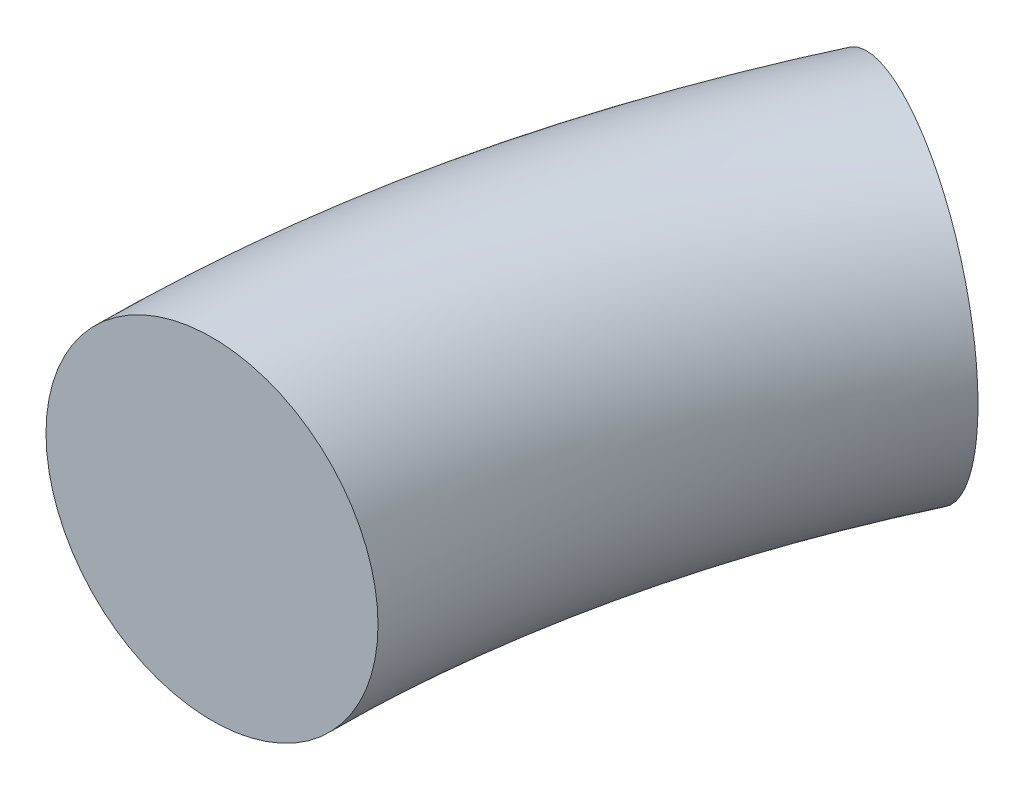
ISO-10303-21;
HEADER;
FILE_DESCRIPTION(('STEP AP214'),'2;1');
FILE_NAME('part.step','',(''),(''),'','','');
FILE_SCHEMA(('AUTOMOTIVE_DESIGN { 1 0 10303 214 1 1 1 1 }'));
ENDSEC;
DATA;
#1=APPLICATION_CONTEXT('core data for automotive mechanical design processes');
#2=APPLICATION_PROTOCOL_DEFINITION('international standard','automotive_design',2000,#1);
#3=PRODUCT_CONTEXT('',#1,'mechanical');
#4=PRODUCT('Part','Part','',(#3));
#5=PRODUCT_RELATED_PRODUCT_CATEGORY('part','',(#4));
#6=PRODUCT_DEFINITION_FORMATION('','',#4);
#7=PRODUCT_DEFINITION_CONTEXT('part definition',#1,'design');
#8=PRODUCT_DEFINITION('design','',#6,#7);
#9=PRODUCT_DEFINITION_SHAPE('','',#8);
#10=(LENGTH_UNIT() NAMED_UNIT(*) SI_UNIT(.MILLI.,.METRE.));
#11=(NAMED_UNIT(*) PLANE_ANGLE_UNIT() SI_UNIT($,.RADIAN.));
#12=(NAMED_UNIT(*) SI_UNIT($,.STERADIAN.) SOLID_ANGLE_UNIT());
#13=UNCERTAINTY_MEASURE_WITH_UNIT(LENGTH_MEASURE(1.E-05),#10,'distance_accuracy_value','');
#14=(GEOMETRIC_REPRESENTATION_CONTEXT(3) GLOBAL_UNCERTAINTY_ASSIGNED_CONTEXT((#13)) GLOBAL_UNIT_ASSIGNED_CONTEXT((#10,
#11,#12)) REPRESENTATION_CONTEXT('',''));
#15=CARTESIAN_POINT('',(0.,0.,0.));
#16=DIRECTION('',(0.,0.,1.));
#17=DIRECTION('',(1.,0.,0.));
#18=AXIS2_PLACEMENT_3D('',#15,#16,#17);
#19=CARTESIAN_POINT('',(-30.1011124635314,9.3821649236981,0.));
#20=DIRECTION('',(0.,1.,0.));
#21=DIRECTION('',(0.,0.,1.));
#22=AXIS2_PLACEMENT_3D('',#19,#20,#21);
#23=TOROIDAL_SURFACE('',#22,4.76250000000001,0.595312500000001);
#24=CARTESIAN_POINT('',(-34.4174032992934,9.3821649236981,-2.01271947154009));
#25=DIRECTION('',(-0.4226182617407,0.,0.90630778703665));
#26=DIRECTION('',(0.90630778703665,0.,0.4226182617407));
#27=AXIS2_PLACEMENT_3D('',#24,#25,#26);
#28=CIRCLE('',#27,0.595312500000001);
#29=CARTESIAN_POINT('',(-34.9569396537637,9.3821649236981,-2.2643094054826));
#30=VERTEX_POINT('',#29);
#31=EDGE_CURVE('E10',#30,#30,#28,.T.);
#32=CARTESIAN_POINT('',(-34.8636124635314,9.3821649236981,0.));
#33=DIRECTION('',(0.,0.,1.));
#34=DIRECTION('',(1.,0.,0.));
#35=AXIS2_PLACEMENT_3D('',#32,#33,#34);
#36=CIRCLE('',#35,0.595312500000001);
#37=CARTESIAN_POINT('',(-35.4589249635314,9.3821649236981,0.));
#38=VERTEX_POINT('',#37);
#39=EDGE_CURVE('E34',#38,#38,#36,.T.);
#40=CARTESIAN_POINT('',(-30.1011124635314,9.3821649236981,0.));
#41=DIRECTION('',(0.,1.,0.));
#42=DIRECTION('',(0.,0.,1.));
#43=AXIS2_PLACEMENT_3D('',#40,#41,#42);
#44=CIRCLE('',#43,5.35781250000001);
#45=EDGE_CURVE('',#30,#38,#44,.T.);
#46=ORIENTED_EDGE('',*,*,#31,.T.);
#47=ORIENTED_EDGE('',*,*,#39,.F.);
#48=ORIENTED_EDGE('',*,*,#45,.T.);
#49=ORIENTED_EDGE('',*,*,#45,.F.);
#50=EDGE_LOOP('',(#46,#48,#47,#49));
#51=FACE_BOUND('',#50,.T.);
#52=ADVANCED_FACE('F28',(#51),#23,.T.);
#53=CARTESIAN_POINT('',(-34.4174032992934,9.3821649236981,-2.01271947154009));
#54=DIRECTION('',(-0.4226182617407,0.,0.90630778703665));
#55=DIRECTION('',(0.90630778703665,0.,0.4226182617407));
#56=AXIS2_PLACEMENT_3D('',#53,#54,#55);
#57=PLANE('',#56);
#58=ORIENTED_EDGE('',*,*,#31,.F.);
#59=EDGE_LOOP('',(#58));
#60=FACE_BOUND('',#59,.T.);
#61=ADVANCED_FACE('F43',(#60),#57,.F.);
#62=CARTESIAN_POINT('',(-34.8636124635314,9.3821649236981,0.));
#63=DIRECTION('',(0.,0.,1.));
#64=DIRECTION('',(1.,0.,0.));
#65=AXIS2_PLACEMENT_3D('',#62,#63,#64);
#66=PLANE('',#65);
#67=ORIENTED_EDGE('',*,*,#39,.T.);
#68=EDGE_LOOP('',(#67));
#69=FACE_BOUND('',#68,.T.);
#70=ADVANCED_FACE('F40',(#69),#66,.T.);
#71=CLOSED_SHELL('',(#52,#61,#70));
#72=MANIFOLD_SOLID_BREP('B2',#71);
#73=ADVANCED_BREP_SHAPE_REPRESENTATION('',(#18,#72),#14);
#74=SHAPE_DEFINITION_REPRESENTATION(#9,#73);
ENDSEC;
END-ISO-10303-21;
